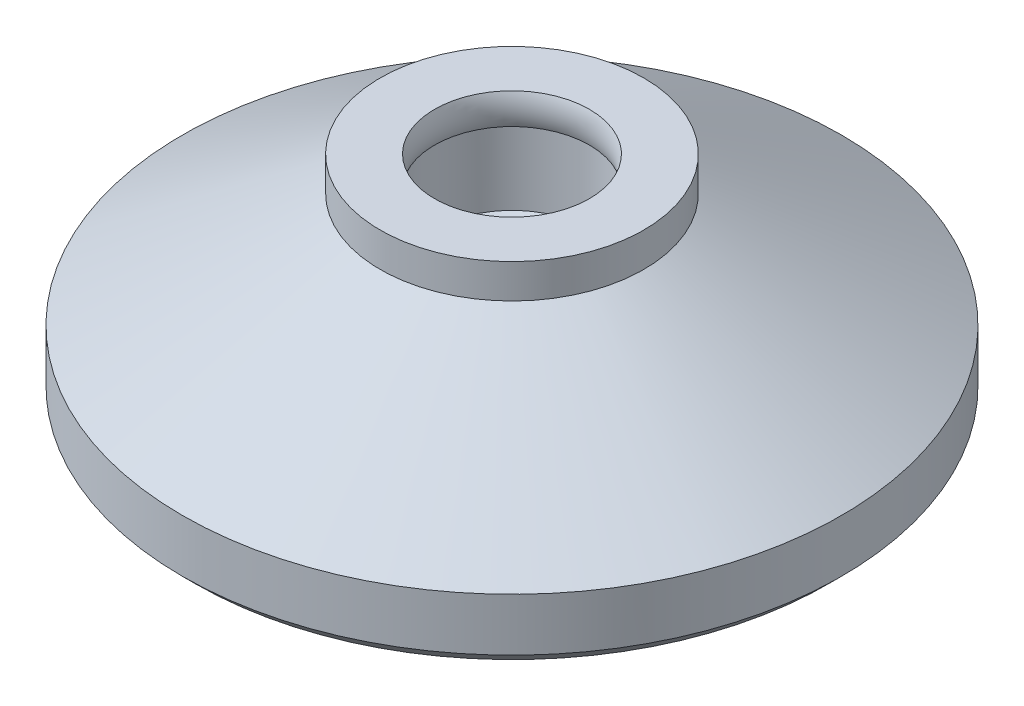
ISO-10303-21;
HEADER;
FILE_DESCRIPTION(('STEP AP214'),'2;1');
FILE_NAME('part.step','',(''),(''),'','','');
FILE_SCHEMA(('AUTOMOTIVE_DESIGN { 1 0 10303 214 1 1 1 1 }'));
ENDSEC;
DATA;
#1=APPLICATION_CONTEXT('core data for automotive mechanical design processes');
#2=APPLICATION_PROTOCOL_DEFINITION('international standard','automotive_design',2000,#1);
#3=PRODUCT_CONTEXT('',#1,'mechanical');
#4=PRODUCT('Part','Part','',(#3));
#5=PRODUCT_RELATED_PRODUCT_CATEGORY('part','',(#4));
#6=PRODUCT_DEFINITION_FORMATION('','',#4);
#7=PRODUCT_DEFINITION_CONTEXT('part definition',#1,'design');
#8=PRODUCT_DEFINITION('design','',#6,#7);
#9=PRODUCT_DEFINITION_SHAPE('','',#8);
#10=(LENGTH_UNIT() NAMED_UNIT(*) SI_UNIT(.MILLI.,.METRE.));
#11=(NAMED_UNIT(*) PLANE_ANGLE_UNIT() SI_UNIT($,.RADIAN.));
#12=(NAMED_UNIT(*) SI_UNIT($,.STERADIAN.) SOLID_ANGLE_UNIT());
#13=UNCERTAINTY_MEASURE_WITH_UNIT(LENGTH_MEASURE(1.E-05),#10,'distance_accuracy_value','');
#14=(GEOMETRIC_REPRESENTATION_CONTEXT(3) GLOBAL_UNCERTAINTY_ASSIGNED_CONTEXT((#13)) GLOBAL_UNIT_ASSIGNED_CONTEXT((#10,
#11,#12)) REPRESENTATION_CONTEXT('',''));
#15=CARTESIAN_POINT('',(0.,0.,0.));
#16=DIRECTION('',(0.,0.,1.));
#17=DIRECTION('',(1.,0.,0.));
#18=AXIS2_PLACEMENT_3D('',#15,#16,#17);
#19=CARTESIAN_POINT('',(0.,6.5,0.));
#20=DIRECTION('',(0.,-1.,0.));
#21=DIRECTION('',(0.,0.,-1.));
#22=AXIS2_PLACEMENT_3D('',#19,#20,#21);
#23=CYLINDRICAL_SURFACE('',#22,8.);
#24=CARTESIAN_POINT('',(0.,4.42820323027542,0.));
#25=DIRECTION('',(0.,1.,0.));
#26=DIRECTION('',(0.,0.,1.));
#27=AXIS2_PLACEMENT_3D('',#24,#25,#26);
#28=CIRCLE('',#27,8.);
#29=CARTESIAN_POINT('',(0.,4.42820323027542,-8.));
#30=VERTEX_POINT('',#29);
#31=EDGE_CURVE('E91',#30,#30,#28,.T.);
#32=CARTESIAN_POINT('',(0.,6.5,0.));
#33=DIRECTION('',(0.,1.,0.));
#34=DIRECTION('',(0.,0.,1.));
#35=AXIS2_PLACEMENT_3D('',#32,#33,#34);
#36=CIRCLE('',#35,8.);
#37=CARTESIAN_POINT('',(0.,6.5,-8.));
#38=VERTEX_POINT('',#37);
#39=EDGE_CURVE('E93',#38,#38,#36,.T.);
#40=CARTESIAN_POINT('',(0.,4.42820323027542,-8.));
#41=CARTESIAN_POINT('',(0.,4.44978444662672,-8.));
#42=CARTESIAN_POINT('',(0.,4.47136566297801,-8.));
#43=CARTESIAN_POINT('',(0.,4.51452809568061,-8.));
#44=CARTESIAN_POINT('',(0.,4.53610931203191,-8.));
#45=CARTESIAN_POINT('',(0.,4.5792717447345,-8.));
#46=CARTESIAN_POINT('',(0.,4.6008529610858,-8.));
#47=CARTESIAN_POINT('',(0.,4.6440153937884,-8.));
#48=CARTESIAN_POINT('',(0.,4.66559661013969,-8.));
#49=CARTESIAN_POINT('',(0.,4.70875904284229,-8.));
#50=CARTESIAN_POINT('',(0.,4.73034025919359,-8.));
#51=CARTESIAN_POINT('',(0.,4.77350269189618,-8.));
#52=CARTESIAN_POINT('',(0.,4.79508390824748,-8.));
#53=CARTESIAN_POINT('',(0.,4.83824634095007,-8.));
#54=CARTESIAN_POINT('',(0.,4.85982755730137,-8.));
#55=CARTESIAN_POINT('',(0.,4.90298999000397,-8.));
#56=CARTESIAN_POINT('',(0.,4.92457120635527,-8.));
#57=CARTESIAN_POINT('',(0.,4.96773363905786,-8.));
#58=CARTESIAN_POINT('',(0.,4.98931485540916,-8.));
#59=CARTESIAN_POINT('',(0.,5.03247728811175,-8.));
#60=CARTESIAN_POINT('',(0.,5.05405850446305,-8.));
#61=CARTESIAN_POINT('',(0.,5.09722093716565,-8.));
#62=CARTESIAN_POINT('',(0.,5.11880215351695,-8.));
#63=CARTESIAN_POINT('',(0.,5.16196458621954,-8.));
#64=CARTESIAN_POINT('',(0.,5.18354580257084,-8.));
#65=CARTESIAN_POINT('',(0.,5.22670823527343,-8.));
#66=CARTESIAN_POINT('',(0.,5.24828945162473,-8.));
#67=CARTESIAN_POINT('',(0.,5.29145188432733,-8.));
#68=CARTESIAN_POINT('',(0.,5.31303310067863,-8.));
#69=CARTESIAN_POINT('',(0.,5.35619553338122,-8.));
#70=CARTESIAN_POINT('',(0.,5.37777674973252,-8.));
#71=CARTESIAN_POINT('',(0.,5.42093918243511,-8.));
#72=CARTESIAN_POINT('',(0.,5.44252039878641,-8.));
#73=CARTESIAN_POINT('',(0.,5.48568283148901,-8.));
#74=CARTESIAN_POINT('',(0.,5.5072640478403,-8.));
#75=CARTESIAN_POINT('',(0.,5.5504264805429,-8.));
#76=CARTESIAN_POINT('',(0.,5.5720076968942,-8.));
#77=CARTESIAN_POINT('',(0.,5.61517012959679,-8.));
#78=CARTESIAN_POINT('',(0.,5.63675134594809,-8.));
#79=CARTESIAN_POINT('',(0.,5.67991377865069,-8.));
#80=CARTESIAN_POINT('',(0.,5.70149499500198,-8.));
#81=CARTESIAN_POINT('',(0.,5.74465742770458,-8.));
#82=CARTESIAN_POINT('',(0.,5.76623864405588,-8.));
#83=CARTESIAN_POINT('',(0.,5.80940107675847,-8.));
#84=CARTESIAN_POINT('',(0.,5.83098229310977,-8.));
#85=CARTESIAN_POINT('',(0.,5.87414472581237,-8.));
#86=CARTESIAN_POINT('',(0.,5.89572594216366,-8.));
#87=CARTESIAN_POINT('',(0.,5.93888837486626,-8.));
#88=CARTESIAN_POINT('',(0.,5.96046959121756,-8.));
#89=CARTESIAN_POINT('',(0.,6.00363202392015,-8.));
#90=CARTESIAN_POINT('',(0.,6.02521324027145,-8.));
#91=CARTESIAN_POINT('',(0.,6.06837567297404,-8.));
#92=CARTESIAN_POINT('',(0.,6.08995688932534,-8.));
#93=CARTESIAN_POINT('',(0.,6.13311932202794,-8.));
#94=CARTESIAN_POINT('',(0.,6.15470053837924,-8.));
#95=CARTESIAN_POINT('',(0.,6.19786297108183,-8.));
#96=CARTESIAN_POINT('',(0.,6.21944418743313,-8.));
#97=CARTESIAN_POINT('',(0.,6.26260662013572,-8.));
#98=CARTESIAN_POINT('',(0.,6.28418783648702,-8.));
#99=CARTESIAN_POINT('',(0.,6.32735026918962,-8.));
#100=CARTESIAN_POINT('',(0.,6.34893148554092,-8.));
#101=CARTESIAN_POINT('',(0.,6.39209391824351,-8.));
#102=CARTESIAN_POINT('',(0.,6.41367513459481,-8.));
#103=CARTESIAN_POINT('',(0.,6.4568375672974,-8.));
#104=CARTESIAN_POINT('',(0.,6.4784187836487,-8.));
#105=CARTESIAN_POINT('',(0.,6.5,-8.));
#106=B_SPLINE_CURVE_WITH_KNOTS('',3,(#40,#41,#42,#43,#44,#45,#46,#47,#48,#49,#50,#51,#52,#53,
#54,#55,#56,#57,#58,#59,#60,#61,#62,#63,#64,#65,#66,#67,#68,#69,#70,#71,#72,#73,#74,#75,#76,#77,
#78,#79,#80,#81,#82,#83,#84,#85,#86,#87,#88,#89,#90,#91,#92,#93,#94,#95,#96,#97,#98,#99,#100,
#101,#102,#103,#104,#105),.UNSPECIFIED.,.F.,.F.,(4,2,2,2,2,2,2,2,2,2,2,2,2,2,2,2,2,2,2,2,2,2,2,
2,2,2,2,2,2,2,2,2,4),(0.,0.064743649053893,0.129487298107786,0.194230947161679,
0.258974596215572,0.323718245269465,0.388461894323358,0.453205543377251,0.517949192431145,
0.582692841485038,0.647436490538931,0.712180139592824,0.776923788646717,0.841667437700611,
0.906411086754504,0.971154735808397,1.03589838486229,1.10064203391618,1.16538568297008,
1.23012933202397,1.29487298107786,1.35961663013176,1.42436027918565,1.48910392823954,
1.55384757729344,1.61859122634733,1.68333487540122,1.74807852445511,1.81282217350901,
1.8775658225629,1.94230947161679,2.00705312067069,2.07179676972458),.UNSPECIFIED.);
#107=EDGE_CURVE('BSEAM37',#30,#38,#106,.T.);
#108=ORIENTED_EDGE('',*,*,#31,.T.);
#109=ORIENTED_EDGE('',*,*,#39,.F.);
#110=ORIENTED_EDGE('',*,*,#107,.T.);
#111=ORIENTED_EDGE('',*,*,#107,.F.);
#112=EDGE_LOOP('',(#108,#110,#109,#111));
#113=FACE_BOUND('',#112,.T.);
#114=ADVANCED_FACE('F37',(#113),#23,.T.);
#115=CARTESIAN_POINT('',(0.,6.5,0.));
#116=DIRECTION('',(0.,1.,0.));
#117=DIRECTION('',(0.,0.,1.));
#118=AXIS2_PLACEMENT_3D('',#115,#116,#117);
#119=PLANE('',#118);
#120=CARTESIAN_POINT('',(0.,6.5,0.));
#121=DIRECTION('',(0.,-1.,0.));
#122=DIRECTION('',(0.,0.,-1.));
#123=AXIS2_PLACEMENT_3D('',#120,#121,#122);
#124=CIRCLE('',#123,4.7);
#125=CARTESIAN_POINT('',(0.,6.5,-4.7));
#126=VERTEX_POINT('',#125);
#127=EDGE_CURVE('E111',#126,#126,#124,.T.);
#128=ORIENTED_EDGE('',*,*,#127,.T.);
#129=EDGE_LOOP('',(#128));
#130=FACE_BOUND('',#129,.T.);
#131=ORIENTED_EDGE('',*,*,#39,.T.);
#132=EDGE_LOOP('',(#131));
#133=FACE_BOUND('',#132,.T.);
#134=ADVANCED_FACE('F65',(#130,#133),#119,.T.);
#135=CARTESIAN_POINT('',(0.,4.42820323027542,0.));
#136=DIRECTION('',(0.,-1.,0.));
#137=DIRECTION('',(0.,0.,-1.));
#138=AXIS2_PLACEMENT_3D('',#135,#136,#137);
#139=CONICAL_SURFACE('',#138,8.,1.0471975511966);
#140=CARTESIAN_POINT('',(0.,-2.5,0.));
#141=DIRECTION('',(0.,1.,0.));
#142=DIRECTION('',(0.,0.,1.));
#143=AXIS2_PLACEMENT_3D('',#140,#141,#142);
#144=CIRCLE('',#143,20.);
#145=CARTESIAN_POINT('',(0.,-2.5,20.));
#146=VERTEX_POINT('',#145);
#147=EDGE_CURVE('E89',#146,#146,#144,.T.);
#148=ORIENTED_EDGE('',*,*,#147,.T.);
#149=EDGE_LOOP('',(#148));
#150=FACE_BOUND('',#149,.T.);
#151=ORIENTED_EDGE('',*,*,#31,.F.);
#152=EDGE_LOOP('',(#151));
#153=FACE_BOUND('',#152,.T.);
#154=ADVANCED_FACE('F70',(#150,#153),#139,.T.);
#155=CARTESIAN_POINT('',(0.,-6.5,0.));
#156=DIRECTION('',(0.,1.,0.));
#157=DIRECTION('',(0.,0.,1.));
#158=AXIS2_PLACEMENT_3D('',#155,#156,#157);
#159=PLANE('',#158);
#160=CARTESIAN_POINT('',(0.,-6.5,0.));
#161=DIRECTION('',(0.,1.,0.));
#162=DIRECTION('',(0.,0.,1.));
#163=AXIS2_PLACEMENT_3D('',#160,#161,#162);
#164=CIRCLE('',#163,19.2);
#165=CARTESIAN_POINT('',(0.,-6.5,19.2));
#166=VERTEX_POINT('',#165);
#167=EDGE_CURVE('E45',#166,#166,#164,.F.);
#168=ORIENTED_EDGE('',*,*,#167,.T.);
#169=EDGE_LOOP('',(#168));
#170=FACE_BOUND('',#169,.T.);
#171=ADVANCED_FACE('F76',(#170),#159,.F.);
#172=CARTESIAN_POINT('',(0.,-2.5,0.));
#173=DIRECTION('',(0.,-1.,0.));
#174=DIRECTION('',(0.,0.,-1.));
#175=AXIS2_PLACEMENT_3D('',#172,#173,#174);
#176=CYLINDRICAL_SURFACE('',#175,20.);
#177=CARTESIAN_POINT('',(0.,-5.69999999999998,0.));
#178=DIRECTION('',(0.,1.,0.));
#179=DIRECTION('',(0.,0.,1.));
#180=AXIS2_PLACEMENT_3D('',#177,#178,#179);
#181=CIRCLE('',#180,20.);
#182=CARTESIAN_POINT('',(0.,-5.69999999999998,20.));
#183=VERTEX_POINT('',#182);
#184=EDGE_CURVE('E11',#183,#183,#181,.T.);
#185=ORIENTED_EDGE('',*,*,#184,.T.);
#186=EDGE_LOOP('',(#185));
#187=FACE_BOUND('',#186,.T.);
#188=ORIENTED_EDGE('',*,*,#147,.F.);
#189=EDGE_LOOP('',(#188));
#190=FACE_BOUND('',#189,.T.);
#191=ADVANCED_FACE('F60',(#187,#190),#176,.T.);
#192=CARTESIAN_POINT('',(0.,-6.5,0.));
#193=DIRECTION('',(0.,1.,0.));
#194=DIRECTION('',(0.,0.,1.));
#195=AXIS2_PLACEMENT_3D('',#192,#193,#194);
#196=CONICAL_SURFACE('',#195,19.2,0.78539816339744);
#197=CARTESIAN_POINT('',(0.,-5.69999999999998,20.));
#198=CARTESIAN_POINT('',(0.,-5.70833333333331,19.9916666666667));
#199=CARTESIAN_POINT('',(0.,-5.71666666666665,19.9833333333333));
#200=CARTESIAN_POINT('',(0.,-5.73333333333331,19.9666666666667));
#201=CARTESIAN_POINT('',(0.,-5.74166666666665,19.9583333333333));
#202=CARTESIAN_POINT('',(0.,-5.75833333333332,19.9416666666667));
#203=CARTESIAN_POINT('',(0.,-5.76666666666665,19.9333333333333));
#204=CARTESIAN_POINT('',(0.,-5.78333333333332,19.9166666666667));
#205=CARTESIAN_POINT('',(0.,-5.79166666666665,19.9083333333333));
#206=CARTESIAN_POINT('',(0.,-5.80833333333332,19.8916666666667));
#207=CARTESIAN_POINT('',(0.,-5.81666666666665,19.8833333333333));
#208=CARTESIAN_POINT('',(0.,-5.83333333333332,19.8666666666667));
#209=CARTESIAN_POINT('',(0.,-5.84166666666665,19.8583333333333));
#210=CARTESIAN_POINT('',(0.,-5.85833333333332,19.8416666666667));
#211=CARTESIAN_POINT('',(0.,-5.86666666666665,19.8333333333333));
#212=CARTESIAN_POINT('',(0.,-5.88333333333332,19.8166666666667));
#213=CARTESIAN_POINT('',(0.,-5.89166666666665,19.8083333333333));
#214=CARTESIAN_POINT('',(0.,-5.90833333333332,19.7916666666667));
#215=CARTESIAN_POINT('',(0.,-5.91666666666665,19.7833333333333));
#216=CARTESIAN_POINT('',(0.,-5.93333333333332,19.7666666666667));
#217=CARTESIAN_POINT('',(0.,-5.94166666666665,19.7583333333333));
#218=CARTESIAN_POINT('',(0.,-5.95833333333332,19.7416666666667));
#219=CARTESIAN_POINT('',(0.,-5.96666666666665,19.7333333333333));
#220=CARTESIAN_POINT('',(0.,-5.98333333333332,19.7166666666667));
#221=CARTESIAN_POINT('',(0.,-5.99166666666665,19.7083333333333));
#222=CARTESIAN_POINT('',(0.,-6.00833333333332,19.6916666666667));
#223=CARTESIAN_POINT('',(0.,-6.01666666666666,19.6833333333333));
#224=CARTESIAN_POINT('',(0.,-6.03333333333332,19.6666666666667));
#225=CARTESIAN_POINT('',(0.,-6.04166666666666,19.6583333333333));
#226=CARTESIAN_POINT('',(0.,-6.05833333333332,19.6416666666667));
#227=CARTESIAN_POINT('',(0.,-6.06666666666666,19.6333333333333));
#228=CARTESIAN_POINT('',(0.,-6.08333333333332,19.6166666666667));
#229=CARTESIAN_POINT('',(0.,-6.09166666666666,19.6083333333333));
#230=CARTESIAN_POINT('',(0.,-6.10833333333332,19.5916666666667));
#231=CARTESIAN_POINT('',(0.,-6.11666666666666,19.5833333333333));
#232=CARTESIAN_POINT('',(0.,-6.13333333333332,19.5666666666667));
#233=CARTESIAN_POINT('',(0.,-6.14166666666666,19.5583333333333));
#234=CARTESIAN_POINT('',(0.,-6.15833333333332,19.5416666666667));
#235=CARTESIAN_POINT('',(0.,-6.16666666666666,19.5333333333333));
#236=CARTESIAN_POINT('',(0.,-6.18333333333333,19.5166666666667));
#237=CARTESIAN_POINT('',(0.,-6.19166666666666,19.5083333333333));
#238=CARTESIAN_POINT('',(0.,-6.20833333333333,19.4916666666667));
#239=CARTESIAN_POINT('',(0.,-6.21666666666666,19.4833333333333));
#240=CARTESIAN_POINT('',(0.,-6.23333333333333,19.4666666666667));
#241=CARTESIAN_POINT('',(0.,-6.24166666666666,19.4583333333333));
#242=CARTESIAN_POINT('',(0.,-6.25833333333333,19.4416666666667));
#243=CARTESIAN_POINT('',(0.,-6.26666666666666,19.4333333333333));
#244=CARTESIAN_POINT('',(0.,-6.28333333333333,19.4166666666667));
#245=CARTESIAN_POINT('',(0.,-6.29166666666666,19.4083333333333));
#246=CARTESIAN_POINT('',(0.,-6.30833333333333,19.3916666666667));
#247=CARTESIAN_POINT('',(0.,-6.31666666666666,19.3833333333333));
#248=CARTESIAN_POINT('',(0.,-6.33333333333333,19.3666666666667));
#249=CARTESIAN_POINT('',(0.,-6.34166666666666,19.3583333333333));
#250=CARTESIAN_POINT('',(0.,-6.35833333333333,19.3416666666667));
#251=CARTESIAN_POINT('',(0.,-6.36666666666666,19.3333333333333));
#252=CARTESIAN_POINT('',(0.,-6.38333333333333,19.3166666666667));
#253=CARTESIAN_POINT('',(0.,-6.39166666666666,19.3083333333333));
#254=CARTESIAN_POINT('',(0.,-6.40833333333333,19.2916666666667));
#255=CARTESIAN_POINT('',(0.,-6.41666666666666,19.2833333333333));
#256=CARTESIAN_POINT('',(0.,-6.43333333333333,19.2666666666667));
#257=CARTESIAN_POINT('',(0.,-6.44166666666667,19.2583333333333));
#258=CARTESIAN_POINT('',(0.,-6.45833333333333,19.2416666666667));
#259=CARTESIAN_POINT('',(0.,-6.46666666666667,19.2333333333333));
#260=CARTESIAN_POINT('',(0.,-6.48333333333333,19.2166666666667));
#261=CARTESIAN_POINT('',(0.,-6.49166666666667,19.2083333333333));
#262=CARTESIAN_POINT('',(0.,-6.5,19.2));
#263=B_SPLINE_CURVE_WITH_KNOTS('',3,(#197,#198,#199,#200,#201,#202,#203,#204,#205,#206,#207,
#208,#209,#210,#211,#212,#213,#214,#215,#216,#217,#218,#219,#220,#221,#222,#223,#224,#225,#226,
#227,#228,#229,#230,#231,#232,#233,#234,#235,#236,#237,#238,#239,#240,#241,#242,#243,#244,#245,
#246,#247,#248,#249,#250,#251,#252,#253,#254,#255,#256,#257,#258,#259,#260,#261,#262),
.UNSPECIFIED.,.F.,.F.,(4,2,2,2,2,2,2,2,2,2,2,2,2,2,2,2,2,2,2,2,2,2,2,2,2,2,2,2,2,2,2,2,4),(0.,
0.0353553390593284,0.0707106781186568,0.106066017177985,0.141421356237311,0.17677669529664,
0.212132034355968,0.247487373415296,0.282842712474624,0.318198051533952,0.353553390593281,
0.388908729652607,0.424264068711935,0.459619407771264,0.494974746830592,0.53033008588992,
0.565685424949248,0.601040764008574,0.636396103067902,0.671751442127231,0.707106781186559,
0.742462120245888,0.777817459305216,0.813172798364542,0.84852813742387,0.883883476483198,
0.919238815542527,0.954594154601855,0.989949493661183,1.02530483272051,1.06066017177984,
1.09601551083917,1.13137084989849),.UNSPECIFIED.);
#264=EDGE_CURVE('BSEAM39',#183,#166,#263,.T.);
#265=ORIENTED_EDGE('',*,*,#184,.F.);
#266=ORIENTED_EDGE('',*,*,#167,.F.);
#267=ORIENTED_EDGE('',*,*,#264,.T.);
#268=ORIENTED_EDGE('',*,*,#264,.F.);
#269=EDGE_LOOP('',(#265,#267,#266,#268));
#270=FACE_BOUND('',#269,.T.);
#271=ADVANCED_FACE('F39',(#270),#196,.T.);
#272=CARTESIAN_POINT('',(0.,-2.5,0.));
#273=DIRECTION('',(0.,1.,0.));
#274=DIRECTION('',(0.,0.,1.));
#275=AXIS2_PLACEMENT_3D('',#272,#273,#274);
#276=CONICAL_SURFACE('',#275,0.,1.04719755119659);
#277=CARTESIAN_POINT('',(0.,0.213546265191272,0.));
#278=DIRECTION('',(0.,-1.,0.));
#279=DIRECTION('',(0.,0.,-1.));
#280=AXIS2_PLACEMENT_3D('',#277,#278,#279);
#281=CIRCLE('',#280,4.7);
#282=CARTESIAN_POINT('',(0.,0.213546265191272,-4.7));
#283=VERTEX_POINT('',#282);
#284=EDGE_CURVE('E100',#283,#283,#281,.T.);
#285=ORIENTED_EDGE('',*,*,#284,.F.);
#286=EDGE_LOOP('',(#285));
#287=FACE_BOUND('',#286,.T.);
#288=CARTESIAN_POINT('',(0.,-2.5,0.));
#289=VERTEX_POINT('',#288);
#290=VERTEX_LOOP('',#289);
#291=FACE_BOUND('',#290,.T.);
#292=ADVANCED_FACE('F48',(#287,#291),#276,.F.);
#293=CARTESIAN_POINT('',(0.,0.,0.));
#294=DIRECTION('',(0.,-1.,0.));
#295=DIRECTION('',(0.,0.,-1.));
#296=AXIS2_PLACEMENT_3D('',#293,#294,#295);
#297=CYLINDRICAL_SURFACE('',#296,4.7);
#298=CARTESIAN_POINT('',(0.,4.62,0.));
#299=DIRECTION('',(0.,-1.,0.));
#300=DIRECTION('',(0.,0.,-1.));
#301=AXIS2_PLACEMENT_3D('',#298,#299,#300);
#302=CIRCLE('',#301,4.7);
#303=CARTESIAN_POINT('',(0.,4.62,-4.7));
#304=VERTEX_POINT('',#303);
#305=EDGE_CURVE('E109',#304,#304,#302,.T.);
#306=ORIENTED_EDGE('',*,*,#305,.F.);
#307=EDGE_LOOP('',(#306));
#308=FACE_BOUND('',#307,.T.);
#309=ORIENTED_EDGE('',*,*,#284,.T.);
#310=EDGE_LOOP('',(#309));
#311=FACE_BOUND('',#310,.T.);
#312=ADVANCED_FACE('F50',(#308,#311),#297,.F.);
#313=CARTESIAN_POINT('',(0.,5.56,0.));
#314=DIRECTION('',(0.,-1.,0.));
#315=DIRECTION('',(0.,0.,-1.));
#316=AXIS2_PLACEMENT_3D('',#313,#314,#315);
#317=TOROIDAL_SURFACE('',#316,6.956,2.444);
#318=ORIENTED_EDGE('',*,*,#127,.F.);
#319=EDGE_LOOP('',(#318));
#320=FACE_BOUND('',#319,.T.);
#321=ORIENTED_EDGE('',*,*,#305,.T.);
#322=EDGE_LOOP('',(#321));
#323=FACE_BOUND('',#322,.T.);
#324=ADVANCED_FACE('F57',(#320,#323),#317,.T.);
#325=CLOSED_SHELL('',(#114,#134,#154,#171,#191,#271,#292,#312,#324));
#326=MANIFOLD_SOLID_BREP('B2',#325);
#327=ADVANCED_BREP_SHAPE_REPRESENTATION('',(#18,#326),#14);
#328=SHAPE_DEFINITION_REPRESENTATION(#9,#327);
ENDSEC;
END-ISO-10303-21;
